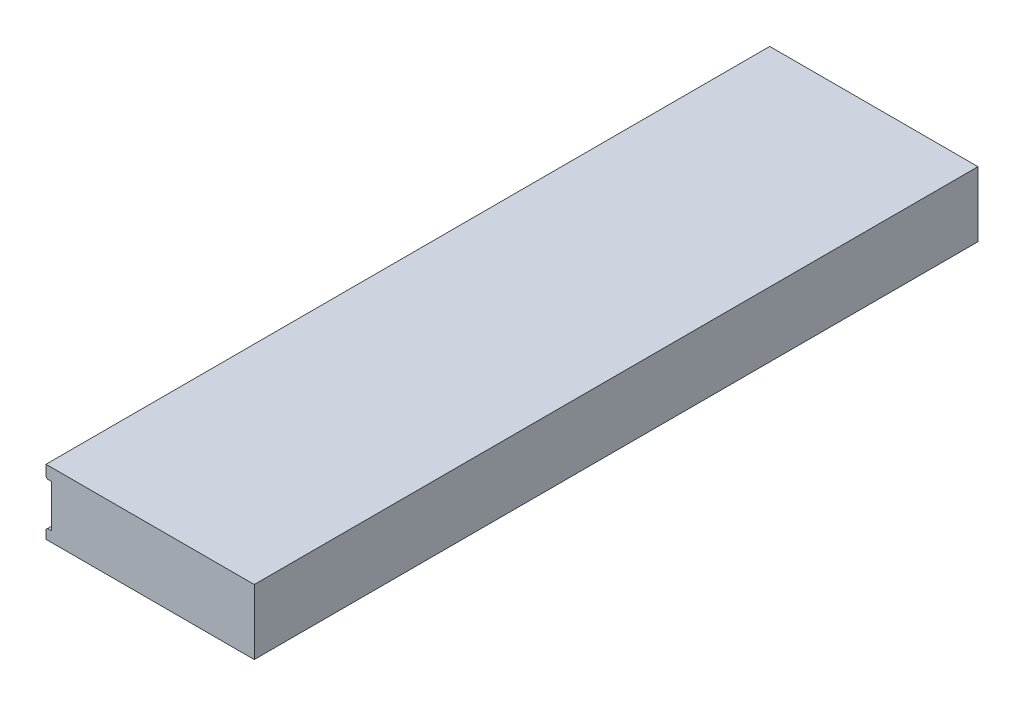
from build123d import *

# Parameters (mm, degrees)
EXTRUDE1_DEPTH                   = 90.4748
F_10_32_TAPPED_HOLE1_D           = 4.0386
F_10_32_TAPPED_HOLE1_DEPTH       = 9.99744
F_10_32_TAPPED_HOLE1_CBORE_D     = 4.826
F_10_32_TAPPED_HOLE1_CBORE_DEPTH = 7.62
F_10_32_TAPPED_HOLE1_TIP         = 1.213317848
CHAMFER1_SIZE                    = 0.381


with BuildPart() as part:
    # Sketch1 → Extrude1 (new, symmetric)
    with BuildSketch(Plane.XY):
        Polygon((50.673, 0), (50.673, -16.256), (-1.397, -16.256), (-1.397, -13.716), (0, -13.716), (0, -3.048), (-1.397, -3.048), (-1.397, 0), align=None)
    extrude(amount=EXTRUDE1_DEPTH, both=True)

    # 10-32 Tapped Hole1
    with Locations(Plane(origin=(0, -8.128, -85.598), x_dir=(0, 0, -1), z_dir=(-1, 0, 0))):
        with Locations((0, 0), (-171.196, 0), (-90.4748, 0), (-80.7212, 0)):
            CounterBoreHole(F_10_32_TAPPED_HOLE1_D / 2, F_10_32_TAPPED_HOLE1_CBORE_D / 2, F_10_32_TAPPED_HOLE1_CBORE_DEPTH, depth=F_10_32_TAPPED_HOLE1_DEPTH)
            with Locations((0, 0, -(F_10_32_TAPPED_HOLE1_DEPTH + F_10_32_TAPPED_HOLE1_TIP / 2))):  # 118° drill point
                Cone(0, F_10_32_TAPPED_HOLE1_D / 2, F_10_32_TAPPED_HOLE1_TIP, mode=Mode.SUBTRACT)

    # Chamfer1
    chamfer1_edges = [part.edges().sort_by_distance(p)[0] for p in [
        (-1.397, -13.716, 0),
        (-1.397, -3.048, 0),
    ]]
    chamfer(chamfer1_edges, length=CHAMFER1_SIZE)


solid = part.part
